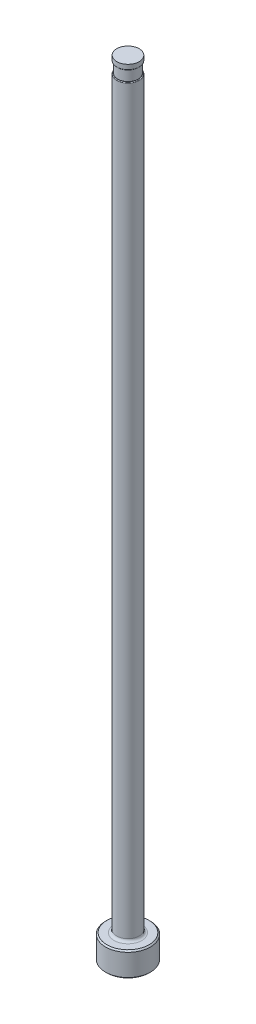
ISO-10303-21;
HEADER;
FILE_DESCRIPTION(('STEP AP214'),'2;1');
FILE_NAME('part.step','',(''),(''),'','','');
FILE_SCHEMA(('AUTOMOTIVE_DESIGN { 1 0 10303 214 1 1 1 1 }'));
ENDSEC;
DATA;
#1=APPLICATION_CONTEXT('core data for automotive mechanical design processes');
#2=APPLICATION_PROTOCOL_DEFINITION('international standard','automotive_design',2000,#1);
#3=PRODUCT_CONTEXT('',#1,'mechanical');
#4=PRODUCT('Part','Part','',(#3));
#5=PRODUCT_RELATED_PRODUCT_CATEGORY('part','',(#4));
#6=PRODUCT_DEFINITION_FORMATION('','',#4);
#7=PRODUCT_DEFINITION_CONTEXT('part definition',#1,'design');
#8=PRODUCT_DEFINITION('design','',#6,#7);
#9=PRODUCT_DEFINITION_SHAPE('','',#8);
#10=(LENGTH_UNIT() NAMED_UNIT(*) SI_UNIT(.MILLI.,.METRE.));
#11=(NAMED_UNIT(*) PLANE_ANGLE_UNIT() SI_UNIT($,.RADIAN.));
#12=(NAMED_UNIT(*) SI_UNIT($,.STERADIAN.) SOLID_ANGLE_UNIT());
#13=UNCERTAINTY_MEASURE_WITH_UNIT(LENGTH_MEASURE(1.E-05),#10,'distance_accuracy_value','');
#14=(GEOMETRIC_REPRESENTATION_CONTEXT(3) GLOBAL_UNCERTAINTY_ASSIGNED_CONTEXT((#13)) GLOBAL_UNIT_ASSIGNED_CONTEXT((#10,
#11,#12)) REPRESENTATION_CONTEXT('',''));
#15=CARTESIAN_POINT('',(0.,0.,0.));
#16=DIRECTION('',(0.,0.,1.));
#17=DIRECTION('',(1.,0.,0.));
#18=AXIS2_PLACEMENT_3D('',#15,#16,#17);
#19=CARTESIAN_POINT('',(-2.18185999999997,151.384,0.));
#20=DIRECTION('',(0.,1.,0.));
#21=DIRECTION('',(0.,0.,1.));
#22=AXIS2_PLACEMENT_3D('',#19,#20,#21);
#23=PLANE('',#22);
#24=CARTESIAN_POINT('',(0.,151.384,0.));
#25=DIRECTION('',(0.,1.,0.));
#26=DIRECTION('',(0.,0.,1.));
#27=AXIS2_PLACEMENT_3D('',#24,#25,#26);
#28=CIRCLE('',#27,2.04977999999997);
#29=CARTESIAN_POINT('',(0.,151.384,2.04977999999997));
#30=VERTEX_POINT('',#29);
#31=EDGE_CURVE('E11',#30,#30,#28,.F.);
#32=ORIENTED_EDGE('',*,*,#31,.T.);
#33=EDGE_LOOP('',(#32));
#34=FACE_BOUND('',#33,.T.);
#35=CARTESIAN_POINT('',(0.,151.384,0.));
#36=DIRECTION('',(0.,1.,0.));
#37=DIRECTION('',(0.,0.,1.));
#38=AXIS2_PLACEMENT_3D('',#35,#36,#37);
#39=CIRCLE('',#38,1.97865999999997);
#40=CARTESIAN_POINT('',(0.,151.384,1.97865999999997));
#41=VERTEX_POINT('',#40);
#42=EDGE_CURVE('E78',#41,#41,#39,.T.);
#43=ORIENTED_EDGE('',*,*,#42,.T.);
#44=EDGE_LOOP('',(#43));
#45=FACE_BOUND('',#44,.T.);
#46=ADVANCED_FACE('F36',(#34,#45),#23,.F.);
#47=CARTESIAN_POINT('',(0.,259.958771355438,0.));
#48=DIRECTION('',(0.,1.,0.));
#49=DIRECTION('',(0.,0.,1.));
#50=AXIS2_PLACEMENT_3D('',#47,#48,#49);
#51=CYLINDRICAL_SURFACE('',#50,2.18185999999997);
#52=DIRECTION('',(0.,1.,0.));
#53=VECTOR('',#52,1.);
#54=CARTESIAN_POINT('',(-1.97865999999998,259.958771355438,-0.919465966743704));
#55=LINE('',#54,#53);
#56=CARTESIAN_POINT('',(-1.97865999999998,149.225,-0.919465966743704));
#57=VERTEX_POINT('',#56);
#58=CARTESIAN_POINT('',(-1.97865999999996,86.868,-0.919465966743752));
#59=VERTEX_POINT('',#58);
#60=EDGE_CURVE('E73',#57,#59,#55,.F.);
#61=ORIENTED_EDGE('',*,*,#60,.F.);
#62=CARTESIAN_POINT('',(0.,149.225,0.));
#63=DIRECTION('',(0.,-1.,0.));
#64=DIRECTION('',(0.,0.,-1.));
#65=AXIS2_PLACEMENT_3D('',#62,#63,#64);
#66=CIRCLE('',#65,2.18185999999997);
#67=CARTESIAN_POINT('',(-1.97865999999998,149.225,0.919465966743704));
#68=VERTEX_POINT('',#67);
#69=EDGE_CURVE('E51',#57,#68,#66,.T.);
#70=ORIENTED_EDGE('',*,*,#69,.T.);
#71=DIRECTION('',(0.,1.,0.));
#72=VECTOR('',#71,1.);
#73=CARTESIAN_POINT('',(-1.97865999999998,259.958771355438,0.919465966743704));
#74=LINE('',#73,#72);
#75=CARTESIAN_POINT('',(-1.97865999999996,86.868,0.919465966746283));
#76=VERTEX_POINT('',#75);
#77=EDGE_CURVE('E84',#76,#68,#74,.T.);
#78=ORIENTED_EDGE('',*,*,#77,.F.);
#79=CARTESIAN_POINT('',(-1.97865999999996,86.868,-0.919465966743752));
#80=CARTESIAN_POINT('',(-1.97865866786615,86.8366405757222,-0.919462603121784));
#81=CARTESIAN_POINT('',(-1.97912506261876,86.8052918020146,-0.918466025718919));
#82=CARTESIAN_POINT('',(-1.98097751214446,86.7427428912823,-0.914466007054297));
#83=CARTESIAN_POINT('',(-1.98236377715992,86.7115427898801,-0.911462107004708));
#84=CARTESIAN_POINT('',(-1.98789143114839,86.6181571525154,-0.899380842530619));
#85=CARTESIAN_POINT('',(-1.99340148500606,86.556411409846,-0.887233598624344));
#86=CARTESIAN_POINT('',(-2.00766626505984,86.4354900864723,-0.854463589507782));
#87=CARTESIAN_POINT('',(-2.01642631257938,86.3763188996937,-0.833826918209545));
#88=CARTESIAN_POINT('',(-2.03642611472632,86.2623500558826,-0.783714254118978));
#89=CARTESIAN_POINT('',(-2.04766149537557,86.2075449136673,-0.754253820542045));
#90=CARTESIAN_POINT('',(-2.06976532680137,86.1114949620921,-0.691040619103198));
#91=CARTESIAN_POINT('',(-2.08046172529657,86.0694280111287,-0.658480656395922));
#92=CARTESIAN_POINT('',(-2.10182499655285,85.991320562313,-0.586722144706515));
#93=CARTESIAN_POINT('',(-2.11249187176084,85.9552795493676,-0.547524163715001));
#94=CARTESIAN_POINT('',(-2.13268121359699,85.8905154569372,-0.4627024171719));
#95=CARTESIAN_POINT('',(-2.14219477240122,85.8618476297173,-0.417033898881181));
#96=CARTESIAN_POINT('',(-2.15871707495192,85.8136764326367,-0.320671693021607));
#97=CARTESIAN_POINT('',(-2.16572797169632,85.7941651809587,-0.269982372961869));
#98=CARTESIAN_POINT('',(-2.17552234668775,85.7673195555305,-0.172335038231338));
#99=CARTESIAN_POINT('',(-2.17874151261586,85.7587183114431,-0.125766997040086));
#100=CARTESIAN_POINT('',(-2.18213487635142,85.7496577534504,-0.0317428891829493));
#101=CARTESIAN_POINT('',(-2.18231070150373,85.7491940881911,0.0157126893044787));
#102=CARTESIAN_POINT('',(-2.17970850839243,85.7561335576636,0.106163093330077));
#103=CARTESIAN_POINT('',(-2.17716289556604,85.7629177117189,0.149213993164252));
#104=CARTESIAN_POINT('',(-2.16974118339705,85.78311834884,0.233509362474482));
#105=CARTESIAN_POINT('',(-2.16486525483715,85.7965343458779,0.274753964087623));
#106=CARTESIAN_POINT('',(-2.15317272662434,85.8297261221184,0.355008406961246));
#107=CARTESIAN_POINT('',(-2.14632875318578,85.8495921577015,0.393976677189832));
#108=CARTESIAN_POINT('',(-2.13136233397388,85.89490710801,0.46823629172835));
#109=CARTESIAN_POINT('',(-2.12323947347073,85.9203578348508,0.50352643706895));
#110=CARTESIAN_POINT('',(-2.1056031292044,85.9786284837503,0.57302033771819));
#111=CARTESIAN_POINT('',(-2.09603057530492,86.0119136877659,0.606817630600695));
#112=CARTESIAN_POINT('',(-2.07698351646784,86.0831137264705,0.66911560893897));
#113=CARTESIAN_POINT('',(-2.0675090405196,86.1210298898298,0.6976147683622));
#114=CARTESIAN_POINT('',(-2.04798045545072,86.2065059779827,0.75318377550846));
#115=CARTESIAN_POINT('',(-2.03805488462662,86.2546575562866,0.779387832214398));
#116=CARTESIAN_POINT('',(-2.02005215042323,86.354471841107,0.824924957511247));
#117=CARTESIAN_POINT('',(-2.01197798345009,86.4061400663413,0.844246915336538));
#118=CARTESIAN_POINT('',(-1.99655433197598,86.5249127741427,0.880207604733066));
#119=CARTESIAN_POINT('',(-1.98987802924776,86.5926743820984,0.895000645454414));
#120=CARTESIAN_POINT('',(-1.98316702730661,86.6954162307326,0.909716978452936));
#121=CARTESIAN_POINT('',(-1.98148063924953,86.7298147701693,0.91337694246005));
#122=CARTESIAN_POINT('',(-1.97922666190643,86.7988033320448,0.918247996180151));
#123=CARTESIAN_POINT('',(-1.97865847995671,86.8333932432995,0.91946038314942));
#124=CARTESIAN_POINT('',(-1.97865999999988,86.8679999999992,0.919465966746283));
#125=B_SPLINE_CURVE_WITH_KNOTS('',3,(#79,#80,#81,#82,#83,#84,#85,#86,#87,#88,#89,#90,#91,#92,
#93,#94,#95,#96,#97,#98,#99,#100,#101,#102,#103,#104,#105,#106,#107,#108,#109,#110,#111,#112,
#113,#114,#115,#116,#117,#118,#119,#120,#121,#122,#123,#124),.UNSPECIFIED.,.F.,.F.,(4,2,2,2,2,2,
2,2,2,2,2,2,2,2,2,2,2,2,2,2,2,2,4),(0.,0.0940372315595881,0.188095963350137,0.376882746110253,
0.565980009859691,0.754745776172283,0.916867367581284,1.07897509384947,1.24226436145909,
1.40541281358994,1.54703759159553,1.68858663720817,1.8189460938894,1.94929599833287,
2.08155476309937,2.21385650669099,2.35846583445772,2.50311675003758,2.66961219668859,
2.83637523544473,3.04438491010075,3.1481998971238,3.25195984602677),.UNSPECIFIED.);
#126=EDGE_CURVE('E81',#59,#76,#125,.T.);
#127=ORIENTED_EDGE('',*,*,#126,.F.);
#128=EDGE_LOOP('',(#61,#70,#78,#127));
#129=FACE_BOUND('',#128,.T.);
#130=CARTESIAN_POINT('',(0.,5.25779999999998,0.));
#131=DIRECTION('',(0.,1.,0.));
#132=DIRECTION('',(0.,0.,1.));
#133=AXIS2_PLACEMENT_3D('',#130,#131,#132);
#134=CIRCLE('',#133,2.18185999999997);
#135=CARTESIAN_POINT('',(0.,5.25779999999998,2.18185999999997));
#136=VERTEX_POINT('',#135);
#137=EDGE_CURVE('E116',#136,#136,#134,.T.);
#138=ORIENTED_EDGE('',*,*,#137,.T.);
#139=EDGE_LOOP('',(#138));
#140=FACE_BOUND('',#139,.T.);
#141=ADVANCED_FACE('F82',(#129,#140),#51,.T.);
#142=CARTESIAN_POINT('',(0.,0.,0.));
#143=DIRECTION('',(0.,-1.,0.));
#144=DIRECTION('',(0.,0.,-1.));
#145=AXIS2_PLACEMENT_3D('',#142,#143,#144);
#146=PLANE('',#145);
#147=CARTESIAN_POINT('',(0.,0.,0.));
#148=DIRECTION('',(0.,-1.,0.));
#149=DIRECTION('',(0.,0.,-1.));
#150=AXIS2_PLACEMENT_3D('',#147,#148,#149);
#151=CIRCLE('',#150,4.10209999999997);
#152=CARTESIAN_POINT('',(0.,0.,-4.10209999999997));
#153=VERTEX_POINT('',#152);
#154=EDGE_CURVE('E113',#153,#153,#151,.T.);
#155=ORIENTED_EDGE('',*,*,#154,.T.);
#156=EDGE_LOOP('',(#155));
#157=FACE_BOUND('',#156,.T.);
#158=ADVANCED_FACE('F192',(#157),#146,.T.);
#159=CARTESIAN_POINT('',(0.,259.958771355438,0.));
#160=DIRECTION('',(0.,1.,0.));
#161=DIRECTION('',(0.,0.,1.));
#162=AXIS2_PLACEMENT_3D('',#159,#160,#161);
#163=CYLINDRICAL_SURFACE('',#162,4.35609999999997);
#164=CARTESIAN_POINT('',(0.,4.49580000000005,0.));
#165=DIRECTION('',(0.,1.,0.));
#166=DIRECTION('',(0.,0.,1.));
#167=AXIS2_PLACEMENT_3D('',#164,#165,#166);
#168=CIRCLE('',#167,4.35609999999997);
#169=CARTESIAN_POINT('',(0.,4.49580000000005,4.35609999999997));
#170=VERTEX_POINT('',#169);
#171=EDGE_CURVE('E110',#170,#170,#168,.F.);
#172=ORIENTED_EDGE('',*,*,#171,.T.);
#173=EDGE_LOOP('',(#172));
#174=FACE_BOUND('',#173,.T.);
#175=CARTESIAN_POINT('',(0.,0.253999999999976,0.));
#176=DIRECTION('',(0.,-1.,0.));
#177=DIRECTION('',(0.,0.,-1.));
#178=AXIS2_PLACEMENT_3D('',#175,#176,#177);
#179=CIRCLE('',#178,4.35609999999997);
#180=CARTESIAN_POINT('',(0.,0.253999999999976,-4.35609999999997));
#181=VERTEX_POINT('',#180);
#182=EDGE_CURVE('E107',#181,#181,#179,.F.);
#183=ORIENTED_EDGE('',*,*,#182,.T.);
#184=EDGE_LOOP('',(#183));
#185=FACE_BOUND('',#184,.T.);
#186=ADVANCED_FACE('F195',(#174,#185),#163,.T.);
#187=CARTESIAN_POINT('',(-4.35609999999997,4.7498,0.));
#188=DIRECTION('',(0.,1.,0.));
#189=DIRECTION('',(0.,0.,1.));
#190=AXIS2_PLACEMENT_3D('',#187,#188,#189);
#191=PLANE('',#190);
#192=CARTESIAN_POINT('',(0.,4.7498,0.));
#193=DIRECTION('',(0.,1.,0.));
#194=DIRECTION('',(0.,0.,1.));
#195=AXIS2_PLACEMENT_3D('',#192,#193,#194);
#196=CIRCLE('',#195,2.68985999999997);
#197=CARTESIAN_POINT('',(0.,4.7498,2.68985999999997));
#198=VERTEX_POINT('',#197);
#199=EDGE_CURVE('E87',#198,#198,#196,.F.);
#200=ORIENTED_EDGE('',*,*,#199,.T.);
#201=EDGE_LOOP('',(#200));
#202=FACE_BOUND('',#201,.T.);
#203=CARTESIAN_POINT('',(0.,4.7498,0.));
#204=DIRECTION('',(0.,1.,0.));
#205=DIRECTION('',(0.,0.,1.));
#206=AXIS2_PLACEMENT_3D('',#203,#204,#205);
#207=CIRCLE('',#206,4.10210000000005);
#208=CARTESIAN_POINT('',(0.,4.7498,4.10210000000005));
#209=VERTEX_POINT('',#208);
#210=EDGE_CURVE('E104',#209,#209,#207,.T.);
#211=ORIENTED_EDGE('',*,*,#210,.T.);
#212=EDGE_LOOP('',(#211));
#213=FACE_BOUND('',#212,.T.);
#214=ADVANCED_FACE('F190',(#202,#213),#191,.T.);
#215=CARTESIAN_POINT('',(0.,4.74980000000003,0.));
#216=DIRECTION('',(0.,-1.,0.));
#217=DIRECTION('',(0.,0.,-1.));
#218=AXIS2_PLACEMENT_3D('',#215,#216,#217);
#219=CONICAL_SURFACE('',#218,4.10210000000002,0.785398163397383);
#220=ORIENTED_EDGE('',*,*,#171,.F.);
#221=EDGE_LOOP('',(#220));
#222=FACE_BOUND('',#221,.T.);
#223=ORIENTED_EDGE('',*,*,#210,.F.);
#224=EDGE_LOOP('',(#223));
#225=FACE_BOUND('',#224,.T.);
#226=ADVANCED_FACE('F186',(#222,#225),#219,.T.);
#227=CARTESIAN_POINT('',(0.,0.253999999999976,0.));
#228=DIRECTION('',(0.,1.,0.));
#229=DIRECTION('',(0.,0.,1.));
#230=AXIS2_PLACEMENT_3D('',#227,#228,#229);
#231=CONICAL_SURFACE('',#230,4.35609999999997,0.785398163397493);
#232=ORIENTED_EDGE('',*,*,#154,.F.);
#233=EDGE_LOOP('',(#232));
#234=FACE_BOUND('',#233,.T.);
#235=ORIENTED_EDGE('',*,*,#182,.F.);
#236=EDGE_LOOP('',(#235));
#237=FACE_BOUND('',#236,.T.);
#238=ADVANCED_FACE('F182',(#234,#237),#231,.T.);
#239=CARTESIAN_POINT('',(0.,5.25779999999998,0.));
#240=DIRECTION('',(0.,1.,0.));
#241=DIRECTION('',(0.,0.,1.));
#242=AXIS2_PLACEMENT_3D('',#239,#240,#241);
#243=TOROIDAL_SURFACE('',#242,2.68985999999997,0.508);
#244=ORIENTED_EDGE('',*,*,#199,.F.);
#245=EDGE_LOOP('',(#244));
#246=FACE_BOUND('',#245,.T.);
#247=ORIENTED_EDGE('',*,*,#137,.F.);
#248=EDGE_LOOP('',(#247));
#249=FACE_BOUND('',#248,.T.);
#250=ADVANCED_FACE('F147',(#246,#249),#243,.F.);
#251=CARTESIAN_POINT('',(-2.18185999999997,149.352,0.));
#252=DIRECTION('',(0.,-1.,0.));
#253=DIRECTION('',(0.,0.,-1.));
#254=AXIS2_PLACEMENT_3D('',#251,#252,#253);
#255=PLANE('',#254);
#256=DIRECTION('',(0.,0.,1.));
#257=VECTOR('',#256,1.);
#258=CARTESIAN_POINT('',(-1.97865999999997,149.352,0.));
#259=LINE('',#258,#257);
#260=CARTESIAN_POINT('',(-1.97865999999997,149.352,0.));
#261=VERTEX_POINT('',#260);
#262=CARTESIAN_POINT('',(-1.97865999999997,149.352,0.554395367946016));
#263=VERTEX_POINT('',#262);
#264=EDGE_CURVE('E90',#261,#263,#259,.T.);
#265=ORIENTED_EDGE('',*,*,#264,.T.);
#266=CARTESIAN_POINT('',(0.,149.352,0.));
#267=DIRECTION('',(0.,-1.,0.));
#268=DIRECTION('',(0.,0.,-1.));
#269=AXIS2_PLACEMENT_3D('',#266,#267,#268);
#270=CIRCLE('',#269,2.05485999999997);
#271=CARTESIAN_POINT('',(-1.97865999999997,149.352,-0.554395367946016));
#272=VERTEX_POINT('',#271);
#273=EDGE_CURVE('E86',#263,#272,#270,.F.);
#274=ORIENTED_EDGE('',*,*,#273,.T.);
#275=EDGE_CURVE('E79',#272,#261,#259,.T.);
#276=ORIENTED_EDGE('',*,*,#275,.T.);
#277=CARTESIAN_POINT('',(0.,149.352,0.));
#278=DIRECTION('',(0.,1.,0.));
#279=DIRECTION('',(0.,0.,1.));
#280=AXIS2_PLACEMENT_3D('',#277,#278,#279);
#281=CIRCLE('',#280,1.97865999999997);
#282=EDGE_CURVE('E101',#261,#261,#281,.T.);
#283=ORIENTED_EDGE('',*,*,#282,.F.);
#284=EDGE_LOOP('',(#265,#274,#276,#283));
#285=FACE_BOUND('',#284,.T.);
#286=ADVANCED_FACE('F144',(#285),#255,.F.);
#287=CARTESIAN_POINT('',(0.,153.448281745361,0.));
#288=DIRECTION('',(0.,1.,0.));
#289=DIRECTION('',(0.,0.,1.));
#290=AXIS2_PLACEMENT_3D('',#287,#288,#289);
#291=CYLINDRICAL_SURFACE('',#290,1.97865999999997);
#292=ORIENTED_EDGE('',*,*,#42,.F.);
#293=EDGE_LOOP('',(#292));
#294=FACE_BOUND('',#293,.T.);
#295=ORIENTED_EDGE('',*,*,#282,.T.);
#296=EDGE_LOOP('',(#295));
#297=FACE_BOUND('',#296,.T.);
#298=ADVANCED_FACE('F141',(#294,#297),#291,.T.);
#299=CARTESIAN_POINT('',(-1.97865999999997,150.368,-4.35609999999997));
#300=DIRECTION('',(1.,0.,0.));
#301=DIRECTION('',(0.,1.,0.));
#302=AXIS2_PLACEMENT_3D('',#299,#300,#301);
#303=PLANE('',#302);
#304=ORIENTED_EDGE('',*,*,#275,.F.);
#305=CARTESIAN_POINT('',(-1.97865999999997,149.352,-0.554395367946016));
#306=CARTESIAN_POINT('',(-1.97865999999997,149.351980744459,-0.575592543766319));
#307=CARTESIAN_POINT('',(-1.97865999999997,149.351610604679,-0.59681069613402));
#308=CARTESIAN_POINT('',(-1.97865999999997,149.349797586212,-0.639399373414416));
#309=CARTESIAN_POINT('',(-1.97865999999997,149.348344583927,-0.660769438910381));
#310=CARTESIAN_POINT('',(-1.97865999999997,149.343969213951,-0.703485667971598));
#311=CARTESIAN_POINT('',(-1.97865999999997,149.341038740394,-0.724831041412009));
#312=CARTESIAN_POINT('',(-1.97865999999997,149.333100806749,-0.767087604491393));
#313=CARTESIAN_POINT('',(-1.97865999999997,149.328102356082,-0.788000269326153));
#314=CARTESIAN_POINT('',(-1.97865999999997,149.319075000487,-0.815870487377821));
#315=CARTESIAN_POINT('',(-1.97865999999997,149.316437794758,-0.823276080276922));
#316=CARTESIAN_POINT('',(-1.97865999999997,149.31061239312,-0.837911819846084));
#317=CARTESIAN_POINT('',(-1.97865999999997,149.307421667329,-0.845140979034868));
#318=CARTESIAN_POINT('',(-1.97865999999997,149.299442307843,-0.861139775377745));
#319=CARTESIAN_POINT('',(-1.97865999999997,149.294454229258,-0.86981168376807));
#320=CARTESIAN_POINT('',(-1.97865999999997,149.283037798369,-0.886141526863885));
#321=CARTESIAN_POINT('',(-1.97865999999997,149.276621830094,-0.893807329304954));
#322=CARTESIAN_POINT('',(-1.97865999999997,149.266411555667,-0.90296400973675));
#323=CARTESIAN_POINT('',(-1.97865999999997,149.26343102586,-0.90535342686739));
#324=CARTESIAN_POINT('',(-1.97865999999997,149.257163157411,-0.909703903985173));
#325=CARTESIAN_POINT('',(-1.97865999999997,149.253875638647,-0.911664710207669));
#326=CARTESIAN_POINT('',(-1.97865999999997,149.246965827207,-0.915035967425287));
#327=CARTESIAN_POINT('',(-1.97865999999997,149.243339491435,-0.916438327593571));
#328=CARTESIAN_POINT('',(-1.97865999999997,149.235884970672,-0.918487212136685));
#329=CARTESIAN_POINT('',(-1.97865999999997,149.232057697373,-0.919136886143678));
#330=CARTESIAN_POINT('',(-1.97865999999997,149.22714216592,-0.91943429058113));
#331=CARTESIAN_POINT('',(-1.97865999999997,149.226070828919,-0.919466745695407));
#332=CARTESIAN_POINT('',(-1.97865999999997,149.225,-0.919465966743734));
#333=B_SPLINE_CURVE_WITH_KNOTS('',3,(#305,#306,#307,#308,#309,#310,#311,#312,#313,#314,#315,
#316,#317,#318,#319,#320,#321,#322,#323,#324,#325,#326,#327,#328,#329,#330,#331,#332),
.UNSPECIFIED.,.F.,.F.,(4,2,2,2,2,2,2,2,2,2,2,2,2,4),(0.,0.0636224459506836,0.127847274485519,
0.192428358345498,0.256731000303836,0.280298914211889,0.30397752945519,0.333913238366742,
0.363598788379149,0.375030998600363,0.386469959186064,0.398069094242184,0.40961951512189,
0.412833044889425),.UNSPECIFIED.);
#334=EDGE_CURVE('E59',#272,#57,#333,.T.);
#335=ORIENTED_EDGE('',*,*,#334,.T.);
#336=ORIENTED_EDGE('',*,*,#60,.T.);
#337=DIRECTION('',(0.,0.,1.));
#338=VECTOR('',#337,1.);
#339=CARTESIAN_POINT('',(-1.97865999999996,86.868,-4.35609999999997));
#340=LINE('',#339,#338);
#341=EDGE_CURVE('E77',#59,#76,#340,.T.);
#342=ORIENTED_EDGE('',*,*,#341,.T.);
#343=ORIENTED_EDGE('',*,*,#77,.T.);
#344=CARTESIAN_POINT('',(-1.97865999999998,149.225,0.919465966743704));
#345=CARTESIAN_POINT('',(-1.97865999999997,149.228299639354,0.919474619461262));
#346=CARTESIAN_POINT('',(-1.97865999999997,149.231588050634,0.919161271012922));
#347=CARTESIAN_POINT('',(-1.97865999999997,149.238024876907,0.917970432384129));
#348=CARTESIAN_POINT('',(-1.97865999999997,149.241174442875,0.917099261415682));
#349=CARTESIAN_POINT('',(-1.97865999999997,149.248004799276,0.914610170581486));
#350=CARTESIAN_POINT('',(-1.97865999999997,149.251638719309,0.912865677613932));
#351=CARTESIAN_POINT('',(-1.97865999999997,149.258587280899,0.908811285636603));
#352=CARTESIAN_POINT('',(-1.97865999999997,149.261900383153,0.906498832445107));
#353=CARTESIAN_POINT('',(-1.97865999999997,149.270031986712,0.899998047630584));
#354=CARTESIAN_POINT('',(-1.97865999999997,149.274602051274,0.895502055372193));
#355=CARTESIAN_POINT('',(-1.97865999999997,149.283028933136,0.885897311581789));
#356=CARTESIAN_POINT('',(-1.97865999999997,149.286884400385,0.880787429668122));
#357=CARTESIAN_POINT('',(-1.97865999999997,149.297507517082,0.865009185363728));
#358=CARTESIAN_POINT('',(-1.97865999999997,149.303441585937,0.853786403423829));
#359=CARTESIAN_POINT('',(-1.97865999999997,149.313811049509,0.830611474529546));
#360=CARTESIAN_POINT('',(-1.97865999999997,149.318233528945,0.818654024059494));
#361=CARTESIAN_POINT('',(-1.97865999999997,149.328746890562,0.78564376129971));
#362=CARTESIAN_POINT('',(-1.97865999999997,149.333742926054,0.764247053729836));
#363=CARTESIAN_POINT('',(-1.97865999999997,149.341629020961,0.721022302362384));
#364=CARTESIAN_POINT('',(-1.97865999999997,149.344509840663,0.69919278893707));
#365=CARTESIAN_POINT('',(-1.97865999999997,149.348633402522,0.656787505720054));
#366=CARTESIAN_POINT('',(-1.97865999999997,149.349968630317,0.636220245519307));
#367=CARTESIAN_POINT('',(-1.97865999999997,149.351639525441,0.595227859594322));
#368=CARTESIAN_POINT('',(-1.97865999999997,149.351984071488,0.574803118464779));
#369=CARTESIAN_POINT('',(-1.97865999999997,149.352,0.55439536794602));
#370=B_SPLINE_CURVE_WITH_KNOTS('',3,(#344,#345,#346,#347,#348,#349,#350,#351,#352,#353,#354,
#355,#356,#357,#358,#359,#360,#361,#362,#363,#364,#365,#366,#367,#368,#369),.UNSPECIFIED.,.F.,
.F.,(4,2,2,2,2,2,2,2,2,2,2,2,4),(0.,0.00986593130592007,0.0196220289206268,0.0316477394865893,
0.0437285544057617,0.0628524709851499,0.0820121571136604,0.119885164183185,0.158074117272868,
0.223787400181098,0.289786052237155,0.351589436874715,0.412837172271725),.UNSPECIFIED.);
#371=EDGE_CURVE('E172',#68,#263,#370,.T.);
#372=ORIENTED_EDGE('',*,*,#371,.T.);
#373=ORIENTED_EDGE('',*,*,#264,.F.);
#374=EDGE_LOOP('',(#304,#335,#336,#342,#343,#372,#373));
#375=FACE_BOUND('',#374,.T.);
#376=ADVANCED_FACE('F75',(#375),#303,.F.);
#377=CARTESIAN_POINT('',(-5.15365999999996,86.868,-4.35609999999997));
#378=DIRECTION('',(0.,0.,1.));
#379=DIRECTION('',(1.,0.,0.));
#380=AXIS2_PLACEMENT_3D('',#377,#378,#379);
#381=CYLINDRICAL_SURFACE('',#380,3.175);
#382=ORIENTED_EDGE('',*,*,#341,.F.);
#383=ORIENTED_EDGE('',*,*,#126,.T.);
#384=EDGE_LOOP('',(#382,#383));
#385=FACE_BOUND('',#384,.T.);
#386=ADVANCED_FACE('F89',(#385),#381,.F.);
#387=CARTESIAN_POINT('',(0.,152.687735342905,0.));
#388=DIRECTION('',(0.,1.,0.));
#389=DIRECTION('',(0.,0.,1.));
#390=AXIS2_PLACEMENT_3D('',#387,#388,#389);
#391=CYLINDRICAL_SURFACE('',#390,2.17677999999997);
#392=CARTESIAN_POINT('',(0.,151.511,0.));
#393=DIRECTION('',(0.,1.,0.));
#394=DIRECTION('',(0.,0.,1.));
#395=AXIS2_PLACEMENT_3D('',#392,#393,#394);
#396=CIRCLE('',#395,2.17677999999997);
#397=CARTESIAN_POINT('',(0.,151.511,2.17677999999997));
#398=VERTEX_POINT('',#397);
#399=EDGE_CURVE('E44',#398,#398,#396,.T.);
#400=ORIENTED_EDGE('',*,*,#399,.T.);
#401=EDGE_LOOP('',(#400));
#402=FACE_BOUND('',#401,.T.);
#403=CARTESIAN_POINT('',(0.,152.4,0.));
#404=DIRECTION('',(0.,1.,0.));
#405=DIRECTION('',(0.,0.,1.));
#406=AXIS2_PLACEMENT_3D('',#403,#404,#405);
#407=CIRCLE('',#406,2.17677999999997);
#408=CARTESIAN_POINT('',(0.,152.4,2.17677999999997));
#409=VERTEX_POINT('',#408);
#410=EDGE_CURVE('E91',#409,#409,#407,.T.);
#411=ORIENTED_EDGE('',*,*,#410,.F.);
#412=EDGE_LOOP('',(#411));
#413=FACE_BOUND('',#412,.T.);
#414=ADVANCED_FACE('F135',(#402,#413),#391,.T.);
#415=CARTESIAN_POINT('',(-2.18185999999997,152.4,0.));
#416=DIRECTION('',(0.,1.,0.));
#417=DIRECTION('',(0.,0.,1.));
#418=AXIS2_PLACEMENT_3D('',#415,#416,#417);
#419=PLANE('',#418);
#420=ORIENTED_EDGE('',*,*,#410,.T.);
#421=EDGE_LOOP('',(#420));
#422=FACE_BOUND('',#421,.T.);
#423=ADVANCED_FACE('F149',(#422),#419,.T.);
#424=CARTESIAN_POINT('',(0.,149.225,0.));
#425=DIRECTION('',(0.,-1.,0.));
#426=DIRECTION('',(0.,0.,-1.));
#427=AXIS2_PLACEMENT_3D('',#424,#425,#426);
#428=TOROIDAL_SURFACE('',#427,2.05485999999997,0.127);
#429=ORIENTED_EDGE('',*,*,#371,.F.);
#430=ORIENTED_EDGE('',*,*,#69,.F.);
#431=ORIENTED_EDGE('',*,*,#334,.F.);
#432=ORIENTED_EDGE('',*,*,#273,.F.);
#433=EDGE_LOOP('',(#429,#430,#431,#432));
#434=FACE_BOUND('',#433,.T.);
#435=ADVANCED_FACE('F151',(#434),#428,.T.);
#436=CARTESIAN_POINT('',(0.,151.511,0.));
#437=DIRECTION('',(0.,1.,0.));
#438=DIRECTION('',(0.,0.,1.));
#439=AXIS2_PLACEMENT_3D('',#436,#437,#438);
#440=TOROIDAL_SURFACE('',#439,2.04977999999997,0.127);
#441=ORIENTED_EDGE('',*,*,#31,.F.);
#442=EDGE_LOOP('',(#441));
#443=FACE_BOUND('',#442,.T.);
#444=ORIENTED_EDGE('',*,*,#399,.F.);
#445=EDGE_LOOP('',(#444));
#446=FACE_BOUND('',#445,.T.);
#447=ADVANCED_FACE('F38',(#443,#446),#440,.T.);
#448=CLOSED_SHELL('',(#46,#141,#158,#186,#214,#226,#238,#250,#286,#298,#376,#386,#414,#423,#435,#447));
#449=MANIFOLD_SOLID_BREP('B2',#448);
#450=ADVANCED_BREP_SHAPE_REPRESENTATION('',(#18,#449),#14);
#451=SHAPE_DEFINITION_REPRESENTATION(#9,#450);
ENDSEC;
END-ISO-10303-21;
